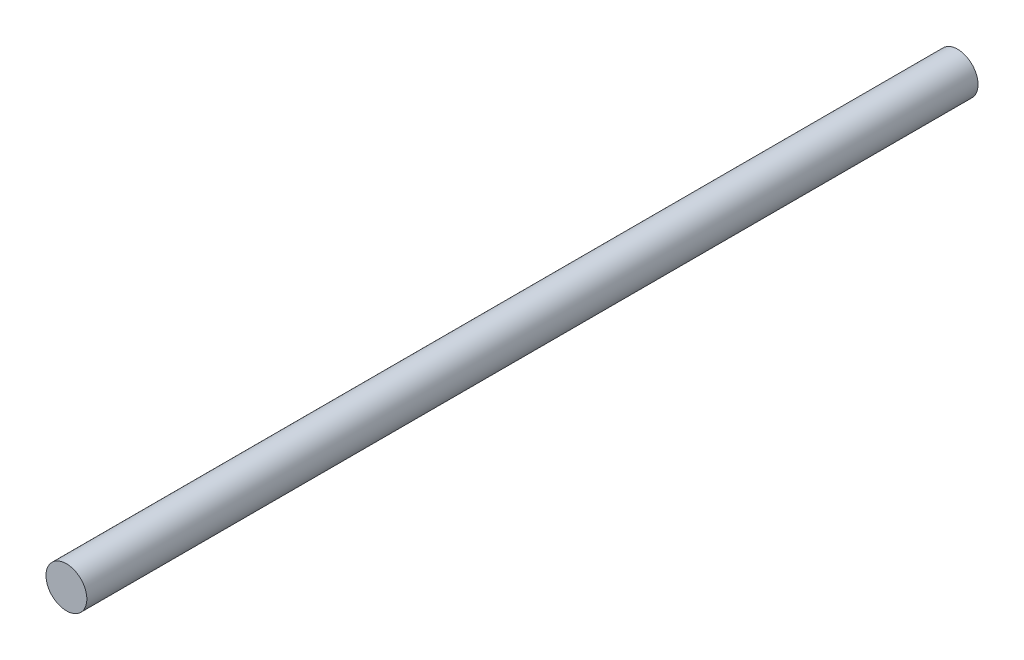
from build123d import *

# Parameters (mm, degrees)
SKETCH1_R          = 18.2626
BASE_EXTRUDE_DEPTH = 398.4625


with BuildPart() as part:
    # Sketch1 → Base-Extrude (new, symmetric)
    with BuildSketch(Plane.XY):
        with Locations(Location((0, 0, 0), (0, 0, 180))):
            Circle(SKETCH1_R)
    extrude(amount=BASE_EXTRUDE_DEPTH, both=True)


solid = part.part
